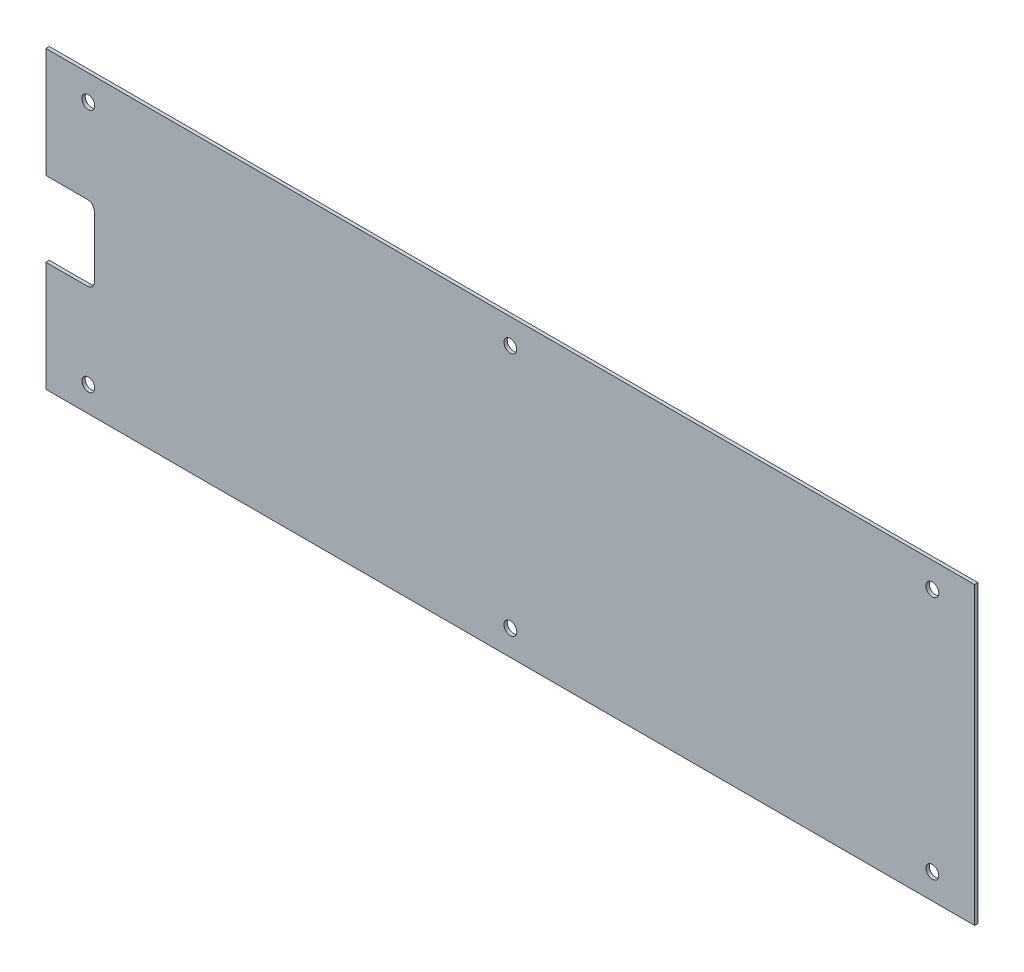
from build123d import *

# Parameters (mm, degrees)
SKETCH1_W        = 219.71
SKETCH1_H        = 69.85
EXTRUDE1_DEPTH   = 0.79375
SKETCH2_R        = 1.524
THRU_HOLES_DEPTH = 231.547471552
NOTCH_DEPTH      = 2.54


with BuildPart() as part:
    # Sketch1 → Extrude1 (new body)
    with BuildSketch(Plane.XY):
        with Locations((109.855, 34.925)):
            Rectangle(SKETCH1_W, SKETCH1_H)
    extrude(amount=EXTRUDE1_DEPTH)

    # Sketch2 → thru_holes (cut, through all)
    with BuildSketch(Plane.XY.offset(0.79375)):
        with Locations((209.7024, 63.8556)):
            Circle(SKETCH2_R)
        with Locations((109.855, 63.8556)):
            Circle(SKETCH2_R)
        with Locations(Location((109.855, 5.9944, 0), (0, 0, 180))):
            Circle(SKETCH2_R)
        with Locations(Location((209.7024, 5.9944, 0), (0, 0, 180))):
            Circle(SKETCH2_R)
        with Locations((10.0076, 5.9944)):
            Circle(SKETCH2_R)
        with Locations(Location((10.0076, 63.8556, 0), (0, 0, 180))):
            Circle(SKETCH2_R)
    extrude(amount=-THRU_HOLES_DEPTH, mode=Mode.SUBTRACT)

    # Sketch4 → notch (cut)
    with BuildSketch(Plane.XY.offset(0.79375)):
        with BuildLine():
            Line((0, 26.035), (0, 43.815))
            Line((0, 43.815), (9.8425, 43.815))
            ThreePointArc((9.8425, 43.815), (10.965032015, 43.350032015), (11.43, 42.2275))
            Line((11.43, 42.2275), (11.43, 27.6225))
            ThreePointArc((11.43, 27.6225), (10.965032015, 26.499967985), (9.8425, 26.035))
            Line((9.8425, 26.035), (0, 26.035))
        make_face()
    extrude(amount=-NOTCH_DEPTH, mode=Mode.SUBTRACT)


solid = part.part
